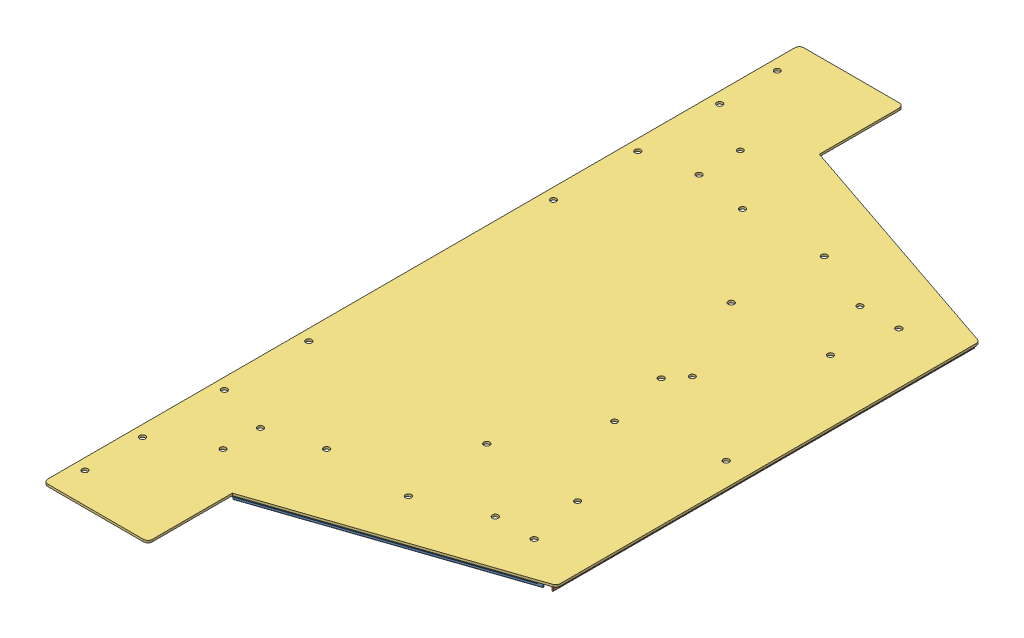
SolidWorks assembly TopBasePlate.SLDASM, configuration Default (file format 15000). Lengths in mm.
Overall size (396.22 15.24 863.61).
4 component instances, 3 part files, 6 mates.
Components (placement in the parent):
- 8982K546_Multipurpose 6061 Aluminum 90 Degree Angle_sides-1: 8982K546_Multipurpose 6061 Aluminum 90 Degree Angle_sides.SLDPRT [8982K546] at (928.1539 1293.4098 1618.7455) x (-0.321489 0 0.946913) z (0.946913 0 0.321489) size (12.7 12.7 279.4)
- 8982K546_Multipurpose 6061 Aluminum 90 Degree Angle_sides-2: 8982K546_Multipurpose 6061 Aluminum 90 Degree Angle_sides.SLDPRT [8982K546] at (928.14 1293.4098 2190.7188) x (0 1 0) z (0.946925 0 -0.321454) size (12.7 12.7 279.4)
- 8982K546_Multipurpose 6061 Aluminum 90 Degree Angle-1: 8982K546_Multipurpose 6061 Aluminum 90 Degree Angle.SLDPRT [8982K546] at (1073.1777 1293.4098 1903.937) x (-1 0 -0.000018) z (-0.000018 0 1) size (12.7 12.7 469.9)
- AlPlate-1: AlPlate.SLDPRT [Default] at (1140.5147 1300.7758 2336.5355) x (0.000018 0 -1) z (1 0 0.000018) size (863.6 2.54 396.2)
Mates (geometry in assembly coordinates):
- Coincident81: coincident anti-aligned: plane of AlPlate-1 through (1140.5147 1299.7598 2336.5355) normal (0 -1 0); plane of 8982K546_Multipurpose 6061 Aluminum 90 Degree Angle_sides-1 through (1062.4791 1299.7598 1657.6447) normal (0 1 0)
- Coincident82: coincident aligned: plane of AlPlate-1 through (1079.5321 1302.2998 1663.4344) normal (0.321489 0 -0.946913); plane of 8982K546_Multipurpose 6061 Aluminum 90 Degree Angle_sides-1 through (1062.4791 1298.966 1657.6447) normal (0.321489 0 -0.946913)
- Coincident79: coincident anti-aligned: plane of AlPlate-1 through (1140.5147 1299.7598 2336.5355) normal (0 -1 0); plane of 8982K546_Multipurpose 6061 Aluminum 90 Degree Angle_sides-2 through (1058.3842 1299.7598 2139.7987) normal (0 1 0)
- Coincident80: coincident aligned: plane of AlPlate-1 through (802.6965 1302.2998 2240.0093) normal (0.321454 0 0.946925); plane of 8982K546_Multipurpose 6061 Aluminum 90 Degree Angle_sides-2 through (1062.4667 1298.966 2151.8246) normal (0.321454 0 0.946925)
- Coincident77: coincident anti-aligned: plane of AlPlate-1 through (1140.5147 1299.7598 2336.5355) normal (0 -1 0); plane of 8982K546_Multipurpose 6061 Aluminum 90 Degree Angle-1 through (1079.5233 1299.7598 2138.8872) normal (0 1 0)
- Coincident78: coincident aligned: plane of AlPlate-1 through (1079.5276 1302.2998 1904.7344) normal (1 0 0.000018); plane of 8982K546_Multipurpose 6061 Aluminum 90 Degree Angle-1 through (1079.5233 1298.966 2138.8872) normal (1 0 0.000018)
